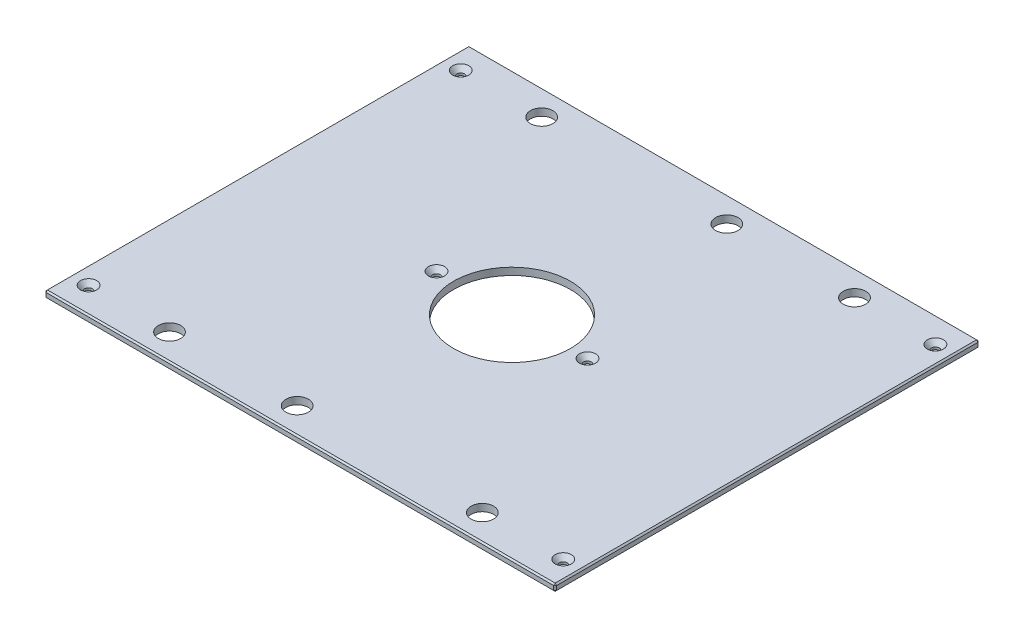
ISO-10303-21;
HEADER;
FILE_DESCRIPTION(('STEP AP214'),'2;1');
FILE_NAME('part.step','',(''),(''),'','','');
FILE_SCHEMA(('AUTOMOTIVE_DESIGN { 1 0 10303 214 1 1 1 1 }'));
ENDSEC;
DATA;
#1=APPLICATION_CONTEXT('core data for automotive mechanical design processes');
#2=APPLICATION_PROTOCOL_DEFINITION('international standard','automotive_design',2000,#1);
#3=PRODUCT_CONTEXT('',#1,'mechanical');
#4=PRODUCT('Part','Part','',(#3));
#5=PRODUCT_RELATED_PRODUCT_CATEGORY('part','',(#4));
#6=PRODUCT_DEFINITION_FORMATION('','',#4);
#7=PRODUCT_DEFINITION_CONTEXT('part definition',#1,'design');
#8=PRODUCT_DEFINITION('design','',#6,#7);
#9=PRODUCT_DEFINITION_SHAPE('','',#8);
#10=(LENGTH_UNIT() NAMED_UNIT(*) SI_UNIT(.MILLI.,.METRE.));
#11=(NAMED_UNIT(*) PLANE_ANGLE_UNIT() SI_UNIT($,.RADIAN.));
#12=(NAMED_UNIT(*) SI_UNIT($,.STERADIAN.) SOLID_ANGLE_UNIT());
#13=UNCERTAINTY_MEASURE_WITH_UNIT(LENGTH_MEASURE(1.E-05),#10,'distance_accuracy_value','');
#14=(GEOMETRIC_REPRESENTATION_CONTEXT(3) GLOBAL_UNCERTAINTY_ASSIGNED_CONTEXT((#13)) GLOBAL_UNIT_ASSIGNED_CONTEXT((#10,
#11,#12)) REPRESENTATION_CONTEXT('',''));
#15=CARTESIAN_POINT('',(0.,0.,0.));
#16=DIRECTION('',(0.,0.,1.));
#17=DIRECTION('',(1.,0.,0.));
#18=AXIS2_PLACEMENT_3D('',#15,#16,#17);
#19=CARTESIAN_POINT('',(-225.425,6.35,-187.325));
#20=DIRECTION('',(1.,0.,0.));
#21=DIRECTION('',(0.,0.,-1.));
#22=AXIS2_PLACEMENT_3D('',#19,#20,#21);
#23=PLANE('',#22);
#24=DIRECTION('',(0.,0.,-1.));
#25=VECTOR('',#24,1.);
#26=CARTESIAN_POINT('',(-225.425,5.08000000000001,-187.325));
#27=LINE('',#26,#25);
#28=CARTESIAN_POINT('',(-225.425,5.08000000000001,186.055));
#29=VERTEX_POINT('',#28);
#30=CARTESIAN_POINT('',(-225.425,5.08000000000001,-186.055));
#31=VERTEX_POINT('',#30);
#32=EDGE_CURVE('E135',#29,#31,#27,.T.);
#33=ORIENTED_EDGE('',*,*,#32,.T.);
#34=DIRECTION('',(0.,-1.,0.));
#35=VECTOR('',#34,1.);
#36=CARTESIAN_POINT('',(-225.425,6.35,-186.055));
#37=LINE('',#36,#35);
#38=CARTESIAN_POINT('',(-225.425,1.26999999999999,-186.055));
#39=VERTEX_POINT('',#38);
#40=EDGE_CURVE('E131',#31,#39,#37,.T.);
#41=ORIENTED_EDGE('',*,*,#40,.T.);
#42=DIRECTION('',(0.,0.,1.));
#43=VECTOR('',#42,1.);
#44=CARTESIAN_POINT('',(-225.425,1.26999999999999,-187.325));
#45=LINE('',#44,#43);
#46=CARTESIAN_POINT('',(-225.425,1.26999999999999,186.055));
#47=VERTEX_POINT('',#46);
#48=EDGE_CURVE('E126',#39,#47,#45,.T.);
#49=ORIENTED_EDGE('',*,*,#48,.T.);
#50=DIRECTION('',(0.,1.,0.));
#51=VECTOR('',#50,1.);
#52=CARTESIAN_POINT('',(-225.425,6.35,186.055));
#53=LINE('',#52,#51);
#54=EDGE_CURVE('E128',#47,#29,#53,.T.);
#55=ORIENTED_EDGE('',*,*,#54,.T.);
#56=EDGE_LOOP('',(#33,#41,#49,#55));
#57=FACE_BOUND('',#56,.T.);
#58=ADVANCED_FACE('F35',(#57),#23,.F.);
#59=CARTESIAN_POINT('',(-225.425,6.35,187.325));
#60=DIRECTION('',(0.,0.,-1.));
#61=DIRECTION('',(-1.,0.,0.));
#62=AXIS2_PLACEMENT_3D('',#59,#60,#61);
#63=PLANE('',#62);
#64=DIRECTION('',(1.,0.,0.));
#65=VECTOR('',#64,1.);
#66=CARTESIAN_POINT('',(-225.425,1.26999999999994,187.325));
#67=LINE('',#66,#65);
#68=CARTESIAN_POINT('',(-224.155,1.26999999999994,187.325));
#69=VERTEX_POINT('',#68);
#70=CARTESIAN_POINT('',(224.155,1.26999999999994,187.325));
#71=VERTEX_POINT('',#70);
#72=EDGE_CURVE('E58',#69,#71,#67,.T.);
#73=ORIENTED_EDGE('',*,*,#72,.T.);
#74=DIRECTION('',(0.,1.,0.));
#75=VECTOR('',#74,1.);
#76=CARTESIAN_POINT('',(224.155,6.35,187.325));
#77=LINE('',#76,#75);
#78=CARTESIAN_POINT('',(224.155,5.08000000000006,187.325));
#79=VERTEX_POINT('',#78);
#80=EDGE_CURVE('E11',#71,#79,#77,.T.);
#81=ORIENTED_EDGE('',*,*,#80,.T.);
#82=DIRECTION('',(-1.,0.,0.));
#83=VECTOR('',#82,1.);
#84=CARTESIAN_POINT('',(-225.425,5.08000000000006,187.325));
#85=LINE('',#84,#83);
#86=CARTESIAN_POINT('',(-224.155,5.08000000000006,187.325));
#87=VERTEX_POINT('',#86);
#88=EDGE_CURVE('E44',#79,#87,#85,.T.);
#89=ORIENTED_EDGE('',*,*,#88,.T.);
#90=DIRECTION('',(0.,-1.,0.));
#91=VECTOR('',#90,1.);
#92=CARTESIAN_POINT('',(-224.155,6.35,187.325));
#93=LINE('',#92,#91);
#94=EDGE_CURVE('E291',#87,#69,#93,.T.);
#95=ORIENTED_EDGE('',*,*,#94,.T.);
#96=EDGE_LOOP('',(#73,#81,#89,#95));
#97=FACE_BOUND('',#96,.T.);
#98=ADVANCED_FACE('F360',(#97),#63,.F.);
#99=CARTESIAN_POINT('',(225.425,6.35,-187.325));
#100=DIRECTION('',(-1.,0.,0.));
#101=DIRECTION('',(0.,0.,1.));
#102=AXIS2_PLACEMENT_3D('',#99,#100,#101);
#103=PLANE('',#102);
#104=DIRECTION('',(0.,0.,-1.));
#105=VECTOR('',#104,1.);
#106=CARTESIAN_POINT('',(225.425,1.26999999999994,-187.325));
#107=LINE('',#106,#105);
#108=CARTESIAN_POINT('',(225.425,1.26999999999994,186.055));
#109=VERTEX_POINT('',#108);
#110=CARTESIAN_POINT('',(225.425,1.26999999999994,-186.055));
#111=VERTEX_POINT('',#110);
#112=EDGE_CURVE('E286',#109,#111,#107,.T.);
#113=ORIENTED_EDGE('',*,*,#112,.T.);
#114=DIRECTION('',(0.,1.,0.));
#115=VECTOR('',#114,1.);
#116=CARTESIAN_POINT('',(225.425,6.35,-186.055));
#117=LINE('',#116,#115);
#118=CARTESIAN_POINT('',(225.425,5.08000000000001,-186.055));
#119=VERTEX_POINT('',#118);
#120=EDGE_CURVE('E288',#111,#119,#117,.T.);
#121=ORIENTED_EDGE('',*,*,#120,.T.);
#122=DIRECTION('',(0.,0.,1.));
#123=VECTOR('',#122,1.);
#124=CARTESIAN_POINT('',(225.425,5.08000000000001,187.325));
#125=LINE('',#124,#123);
#126=CARTESIAN_POINT('',(225.425,5.08000000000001,186.055));
#127=VERTEX_POINT('',#126);
#128=EDGE_CURVE('E284',#119,#127,#125,.T.);
#129=ORIENTED_EDGE('',*,*,#128,.T.);
#130=DIRECTION('',(0.,-1.,0.));
#131=VECTOR('',#130,1.);
#132=CARTESIAN_POINT('',(225.425,6.35,186.055));
#133=LINE('',#132,#131);
#134=EDGE_CURVE('E282',#127,#109,#133,.T.);
#135=ORIENTED_EDGE('',*,*,#134,.T.);
#136=EDGE_LOOP('',(#113,#121,#129,#135));
#137=FACE_BOUND('',#136,.T.);
#138=ADVANCED_FACE('F347',(#137),#103,.F.);
#139=CARTESIAN_POINT('',(-225.425,6.35,-187.325));
#140=DIRECTION('',(0.,0.,1.));
#141=DIRECTION('',(1.,0.,0.));
#142=AXIS2_PLACEMENT_3D('',#139,#140,#141);
#143=PLANE('',#142);
#144=DIRECTION('',(-1.,0.,0.));
#145=VECTOR('',#144,1.);
#146=CARTESIAN_POINT('',(-225.425,1.26999999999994,-187.325));
#147=LINE('',#146,#145);
#148=CARTESIAN_POINT('',(224.155,1.26999999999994,-187.325));
#149=VERTEX_POINT('',#148);
#150=CARTESIAN_POINT('',(-224.155,1.26999999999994,-187.325));
#151=VERTEX_POINT('',#150);
#152=EDGE_CURVE('E258',#149,#151,#147,.T.);
#153=ORIENTED_EDGE('',*,*,#152,.T.);
#154=DIRECTION('',(0.,1.,0.));
#155=VECTOR('',#154,1.);
#156=CARTESIAN_POINT('',(-224.155,6.35,-187.325));
#157=LINE('',#156,#155);
#158=CARTESIAN_POINT('',(-224.155,5.08000000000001,-187.325));
#159=VERTEX_POINT('',#158);
#160=EDGE_CURVE('E262',#151,#159,#157,.T.);
#161=ORIENTED_EDGE('',*,*,#160,.T.);
#162=DIRECTION('',(1.,0.,0.));
#163=VECTOR('',#162,1.);
#164=CARTESIAN_POINT('',(225.425,5.08000000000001,-187.325));
#165=LINE('',#164,#163);
#166=CARTESIAN_POINT('',(224.155,5.08000000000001,-187.325));
#167=VERTEX_POINT('',#166);
#168=EDGE_CURVE('E260',#159,#167,#165,.T.);
#169=ORIENTED_EDGE('',*,*,#168,.T.);
#170=DIRECTION('',(0.,-1.,0.));
#171=VECTOR('',#170,1.);
#172=CARTESIAN_POINT('',(224.155,6.35,-187.325));
#173=LINE('',#172,#171);
#174=EDGE_CURVE('E256',#167,#149,#173,.T.);
#175=ORIENTED_EDGE('',*,*,#174,.T.);
#176=EDGE_LOOP('',(#153,#161,#169,#175));
#177=FACE_BOUND('',#176,.T.);
#178=ADVANCED_FACE('F321',(#177),#143,.F.);
#179=CARTESIAN_POINT('',(0.,6.35,0.));
#180=DIRECTION('',(0.,1.,0.));
#181=DIRECTION('',(0.,0.,1.));
#182=AXIS2_PLACEMENT_3D('',#179,#180,#181);
#183=PLANE('',#182);
#184=CARTESIAN_POINT('',(209.55,6.35,-164.30498));
#185=DIRECTION('',(0.,1.,0.));
#186=DIRECTION('',(0.,0.,1.));
#187=AXIS2_PLACEMENT_3D('',#184,#185,#186);
#188=CIRCLE('',#187,7.13739999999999);
#189=CARTESIAN_POINT('',(209.55,6.35,-157.16758));
#190=VERTEX_POINT('',#189);
#191=EDGE_CURVE('E784',#190,#190,#188,.T.);
#192=ORIENTED_EDGE('',*,*,#191,.F.);
#193=EDGE_LOOP('',(#192));
#194=FACE_BOUND('',#193,.T.);
#195=CARTESIAN_POINT('',(209.55,6.35,164.30498));
#196=DIRECTION('',(0.,1.,0.));
#197=DIRECTION('',(0.,0.,1.));
#198=AXIS2_PLACEMENT_3D('',#195,#196,#197);
#199=CIRCLE('',#198,7.13739999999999);
#200=CARTESIAN_POINT('',(209.55,6.35,171.44238));
#201=VERTEX_POINT('',#200);
#202=EDGE_CURVE('E788',#201,#201,#199,.T.);
#203=ORIENTED_EDGE('',*,*,#202,.F.);
#204=EDGE_LOOP('',(#203));
#205=FACE_BOUND('',#204,.T.);
#206=CARTESIAN_POINT('',(-209.55,6.35,164.30498));
#207=DIRECTION('',(0.,1.,0.));
#208=DIRECTION('',(0.,0.,1.));
#209=AXIS2_PLACEMENT_3D('',#206,#207,#208);
#210=CIRCLE('',#209,7.13739999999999);
#211=CARTESIAN_POINT('',(-209.55,6.35,171.44238));
#212=VERTEX_POINT('',#211);
#213=EDGE_CURVE('E792',#212,#212,#210,.T.);
#214=ORIENTED_EDGE('',*,*,#213,.F.);
#215=EDGE_LOOP('',(#214));
#216=FACE_BOUND('',#215,.T.);
#217=CARTESIAN_POINT('',(-66.675,6.35,0.));
#218=DIRECTION('',(0.,1.,0.));
#219=DIRECTION('',(0.,0.,1.));
#220=AXIS2_PLACEMENT_3D('',#217,#218,#219);
#221=CIRCLE('',#220,7.1374);
#222=CARTESIAN_POINT('',(-66.675,6.35,7.1374));
#223=VERTEX_POINT('',#222);
#224=EDGE_CURVE('E796',#223,#223,#221,.T.);
#225=ORIENTED_EDGE('',*,*,#224,.F.);
#226=EDGE_LOOP('',(#225));
#227=FACE_BOUND('',#226,.T.);
#228=CARTESIAN_POINT('',(66.675,6.35,0.));
#229=DIRECTION('',(0.,1.,0.));
#230=DIRECTION('',(0.,0.,1.));
#231=AXIS2_PLACEMENT_3D('',#228,#229,#230);
#232=CIRCLE('',#231,7.1374);
#233=CARTESIAN_POINT('',(66.675,6.35,7.1374));
#234=VERTEX_POINT('',#233);
#235=EDGE_CURVE('E800',#234,#234,#232,.T.);
#236=ORIENTED_EDGE('',*,*,#235,.F.);
#237=EDGE_LOOP('',(#236));
#238=FACE_BOUND('',#237,.T.);
#239=CARTESIAN_POINT('',(-209.55,6.35,-164.30498));
#240=DIRECTION('',(0.,1.,0.));
#241=DIRECTION('',(0.,0.,1.));
#242=AXIS2_PLACEMENT_3D('',#239,#240,#241);
#243=CIRCLE('',#242,7.13739999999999);
#244=CARTESIAN_POINT('',(-209.55,6.35,-157.16758));
#245=VERTEX_POINT('',#244);
#246=EDGE_CURVE('E803',#245,#245,#243,.T.);
#247=ORIENTED_EDGE('',*,*,#246,.F.);
#248=EDGE_LOOP('',(#247));
#249=FACE_BOUND('',#248,.T.);
#250=DIRECTION('',(0.,0.,-1.));
#251=VECTOR('',#250,1.);
#252=CARTESIAN_POINT('',(224.155,6.35,-187.325));
#253=LINE('',#252,#251);
#254=CARTESIAN_POINT('',(224.155,6.35,186.055));
#255=VERTEX_POINT('',#254);
#256=CARTESIAN_POINT('',(224.155,6.35,-186.055));
#257=VERTEX_POINT('',#256);
#258=EDGE_CURVE('E269',#255,#257,#253,.T.);
#259=ORIENTED_EDGE('',*,*,#258,.T.);
#260=DIRECTION('',(-1.,0.,0.));
#261=VECTOR('',#260,1.);
#262=CARTESIAN_POINT('',(-225.425,6.35,-186.055));
#263=LINE('',#262,#261);
#264=CARTESIAN_POINT('',(-224.155,6.35,-186.055));
#265=VERTEX_POINT('',#264);
#266=EDGE_CURVE('E271',#257,#265,#263,.T.);
#267=ORIENTED_EDGE('',*,*,#266,.T.);
#268=DIRECTION('',(0.,0.,1.));
#269=VECTOR('',#268,1.);
#270=CARTESIAN_POINT('',(-224.155,6.35,187.325));
#271=LINE('',#270,#269);
#272=CARTESIAN_POINT('',(-224.155,6.35,186.055));
#273=VERTEX_POINT('',#272);
#274=EDGE_CURVE('E267',#265,#273,#271,.T.);
#275=ORIENTED_EDGE('',*,*,#274,.T.);
#276=DIRECTION('',(1.,0.,0.));
#277=VECTOR('',#276,1.);
#278=CARTESIAN_POINT('',(225.425,6.35,186.055));
#279=LINE('',#278,#277);
#280=EDGE_CURVE('E265',#273,#255,#279,.T.);
#281=ORIENTED_EDGE('',*,*,#280,.T.);
#282=EDGE_LOOP('',(#259,#267,#275,#281));
#283=FACE_BOUND('',#282,.T.);
#284=CARTESIAN_POINT('',(138.1125,6.35,-164.30498));
#285=DIRECTION('',(0.,1.,0.));
#286=DIRECTION('',(0.,0.,1.));
#287=AXIS2_PLACEMENT_3D('',#284,#285,#286);
#288=CIRCLE('',#287,9.921875);
#289=CARTESIAN_POINT('',(138.1125,6.35,-154.383105));
#290=VERTEX_POINT('',#289);
#291=EDGE_CURVE('E204',#290,#290,#288,.T.);
#292=ORIENTED_EDGE('',*,*,#291,.F.);
#293=EDGE_LOOP('',(#292));
#294=FACE_BOUND('',#293,.T.);
#295=CARTESIAN_POINT('',(-138.1125,6.35,-164.30498));
#296=DIRECTION('',(0.,1.,0.));
#297=DIRECTION('',(0.,0.,1.));
#298=AXIS2_PLACEMENT_3D('',#295,#296,#297);
#299=CIRCLE('',#298,9.921875);
#300=CARTESIAN_POINT('',(-138.1125,6.35,-154.383105));
#301=VERTEX_POINT('',#300);
#302=EDGE_CURVE('E214',#301,#301,#299,.T.);
#303=ORIENTED_EDGE('',*,*,#302,.F.);
#304=EDGE_LOOP('',(#303));
#305=FACE_BOUND('',#304,.T.);
#306=CARTESIAN_POINT('',(138.1125,6.35,164.30498));
#307=DIRECTION('',(0.,1.,0.));
#308=DIRECTION('',(0.,0.,1.));
#309=AXIS2_PLACEMENT_3D('',#306,#307,#308);
#310=CIRCLE('',#309,9.921875);
#311=CARTESIAN_POINT('',(138.1125,6.35,174.226855));
#312=VERTEX_POINT('',#311);
#313=EDGE_CURVE('E225',#312,#312,#310,.T.);
#314=ORIENTED_EDGE('',*,*,#313,.F.);
#315=EDGE_LOOP('',(#314));
#316=FACE_BOUND('',#315,.T.);
#317=CARTESIAN_POINT('',(-138.1125,6.35,164.30498));
#318=DIRECTION('',(0.,1.,0.));
#319=DIRECTION('',(0.,0.,1.));
#320=AXIS2_PLACEMENT_3D('',#317,#318,#319);
#321=CIRCLE('',#320,9.921875);
#322=CARTESIAN_POINT('',(-138.1125,6.35,174.226855));
#323=VERTEX_POINT('',#322);
#324=EDGE_CURVE('E231',#323,#323,#321,.T.);
#325=ORIENTED_EDGE('',*,*,#324,.F.);
#326=EDGE_LOOP('',(#325));
#327=FACE_BOUND('',#326,.T.);
#328=CARTESIAN_POINT('',(25.4,6.35,-164.30498));
#329=DIRECTION('',(0.,1.,0.));
#330=DIRECTION('',(0.,0.,1.));
#331=AXIS2_PLACEMENT_3D('',#328,#329,#330);
#332=CIRCLE('',#331,9.921875);
#333=CARTESIAN_POINT('',(25.4,6.35,-154.383105));
#334=VERTEX_POINT('',#333);
#335=EDGE_CURVE('E237',#334,#334,#332,.T.);
#336=ORIENTED_EDGE('',*,*,#335,.F.);
#337=EDGE_LOOP('',(#336));
#338=FACE_BOUND('',#337,.T.);
#339=CARTESIAN_POINT('',(-25.4,6.35,164.30498));
#340=DIRECTION('',(0.,1.,0.));
#341=DIRECTION('',(0.,0.,1.));
#342=AXIS2_PLACEMENT_3D('',#339,#340,#341);
#343=CIRCLE('',#342,9.921875);
#344=CARTESIAN_POINT('',(-25.4,6.35,174.226855));
#345=VERTEX_POINT('',#344);
#346=EDGE_CURVE('E243',#345,#345,#343,.T.);
#347=ORIENTED_EDGE('',*,*,#346,.F.);
#348=EDGE_LOOP('',(#347));
#349=FACE_BOUND('',#348,.T.);
#350=CARTESIAN_POINT('',(0.,6.35,0.));
#351=DIRECTION('',(0.,1.,0.));
#352=DIRECTION('',(0.,0.,1.));
#353=AXIS2_PLACEMENT_3D('',#350,#351,#352);
#354=CIRCLE('',#353,51.562);
#355=CARTESIAN_POINT('',(0.,6.35,51.562));
#356=VERTEX_POINT('',#355);
#357=EDGE_CURVE('E249',#356,#356,#354,.T.);
#358=ORIENTED_EDGE('',*,*,#357,.F.);
#359=EDGE_LOOP('',(#358));
#360=FACE_BOUND('',#359,.T.);
#361=ADVANCED_FACE('F369',(#194,#205,#216,#227,#238,#249,#283,#294,#305,#316,#327,#338,#349,
#360),#183,.T.);
#362=CARTESIAN_POINT('',(0.,0.,0.));
#363=DIRECTION('',(0.,1.,0.));
#364=DIRECTION('',(0.,0.,1.));
#365=AXIS2_PLACEMENT_3D('',#362,#363,#364);
#366=PLANE('',#365);
#367=CARTESIAN_POINT('',(209.55,0.,-164.30498));
#368=DIRECTION('',(0.,1.,0.));
#369=DIRECTION('',(0.,0.,1.));
#370=AXIS2_PLACEMENT_3D('',#367,#368,#369);
#371=CIRCLE('',#370,3.3782);
#372=CARTESIAN_POINT('',(209.55,0.,-160.92678));
#373=VERTEX_POINT('',#372);
#374=EDGE_CURVE('E837',#373,#373,#371,.T.);
#375=ORIENTED_EDGE('',*,*,#374,.T.);
#376=EDGE_LOOP('',(#375));
#377=FACE_BOUND('',#376,.T.);
#378=CARTESIAN_POINT('',(209.55,0.,164.30498));
#379=DIRECTION('',(0.,1.,0.));
#380=DIRECTION('',(0.,0.,1.));
#381=AXIS2_PLACEMENT_3D('',#378,#379,#380);
#382=CIRCLE('',#381,3.3782);
#383=CARTESIAN_POINT('',(209.55,0.,167.68318));
#384=VERTEX_POINT('',#383);
#385=EDGE_CURVE('E830',#384,#384,#382,.T.);
#386=ORIENTED_EDGE('',*,*,#385,.T.);
#387=EDGE_LOOP('',(#386));
#388=FACE_BOUND('',#387,.T.);
#389=CARTESIAN_POINT('',(-209.55,0.,164.30498));
#390=DIRECTION('',(0.,1.,0.));
#391=DIRECTION('',(0.,0.,1.));
#392=AXIS2_PLACEMENT_3D('',#389,#390,#391);
#393=CIRCLE('',#392,3.3782);
#394=CARTESIAN_POINT('',(-209.55,0.,167.68318));
#395=VERTEX_POINT('',#394);
#396=EDGE_CURVE('E823',#395,#395,#393,.T.);
#397=ORIENTED_EDGE('',*,*,#396,.T.);
#398=EDGE_LOOP('',(#397));
#399=FACE_BOUND('',#398,.T.);
#400=CARTESIAN_POINT('',(-66.675,0.,0.));
#401=DIRECTION('',(0.,1.,0.));
#402=DIRECTION('',(0.,0.,1.));
#403=AXIS2_PLACEMENT_3D('',#400,#401,#402);
#404=CIRCLE('',#403,3.3782);
#405=CARTESIAN_POINT('',(-66.675,0.,3.3782));
#406=VERTEX_POINT('',#405);
#407=EDGE_CURVE('E816',#406,#406,#404,.T.);
#408=ORIENTED_EDGE('',*,*,#407,.T.);
#409=EDGE_LOOP('',(#408));
#410=FACE_BOUND('',#409,.T.);
#411=CARTESIAN_POINT('',(66.675,0.,0.));
#412=DIRECTION('',(0.,1.,0.));
#413=DIRECTION('',(0.,0.,1.));
#414=AXIS2_PLACEMENT_3D('',#411,#412,#413);
#415=CIRCLE('',#414,3.3782);
#416=CARTESIAN_POINT('',(66.675,0.,3.3782));
#417=VERTEX_POINT('',#416);
#418=EDGE_CURVE('E806',#417,#417,#415,.T.);
#419=ORIENTED_EDGE('',*,*,#418,.T.);
#420=EDGE_LOOP('',(#419));
#421=FACE_BOUND('',#420,.T.);
#422=CARTESIAN_POINT('',(-209.55,0.,-164.30498));
#423=DIRECTION('',(0.,1.,0.));
#424=DIRECTION('',(0.,0.,1.));
#425=AXIS2_PLACEMENT_3D('',#422,#423,#424);
#426=CIRCLE('',#425,3.3782);
#427=CARTESIAN_POINT('',(-209.55,0.,-160.92678));
#428=VERTEX_POINT('',#427);
#429=EDGE_CURVE('E217',#428,#428,#426,.T.);
#430=ORIENTED_EDGE('',*,*,#429,.T.);
#431=EDGE_LOOP('',(#430));
#432=FACE_BOUND('',#431,.T.);
#433=DIRECTION('',(0.,0.,-1.));
#434=VECTOR('',#433,1.);
#435=CARTESIAN_POINT('',(-224.155,0.,0.));
#436=LINE('',#435,#434);
#437=CARTESIAN_POINT('',(-224.155,0.,186.055));
#438=VERTEX_POINT('',#437);
#439=CARTESIAN_POINT('',(-224.155,0.,-186.055));
#440=VERTEX_POINT('',#439);
#441=EDGE_CURVE('E158',#438,#440,#436,.T.);
#442=ORIENTED_EDGE('',*,*,#441,.T.);
#443=DIRECTION('',(1.,0.,0.));
#444=VECTOR('',#443,1.);
#445=CARTESIAN_POINT('',(0.,0.,-186.055));
#446=LINE('',#445,#444);
#447=CARTESIAN_POINT('',(224.155,0.,-186.055));
#448=VERTEX_POINT('',#447);
#449=EDGE_CURVE('E279',#440,#448,#446,.T.);
#450=ORIENTED_EDGE('',*,*,#449,.T.);
#451=DIRECTION('',(0.,0.,1.));
#452=VECTOR('',#451,1.);
#453=CARTESIAN_POINT('',(224.155,0.,0.));
#454=LINE('',#453,#452);
#455=CARTESIAN_POINT('',(224.155,0.,186.055));
#456=VERTEX_POINT('',#455);
#457=EDGE_CURVE('E277',#448,#456,#454,.T.);
#458=ORIENTED_EDGE('',*,*,#457,.T.);
#459=DIRECTION('',(-1.,0.,0.));
#460=VECTOR('',#459,1.);
#461=CARTESIAN_POINT('',(0.,0.,186.055));
#462=LINE('',#461,#460);
#463=EDGE_CURVE('E274',#456,#438,#462,.T.);
#464=ORIENTED_EDGE('',*,*,#463,.T.);
#465=EDGE_LOOP('',(#442,#450,#458,#464));
#466=FACE_BOUND('',#465,.T.);
#467=CARTESIAN_POINT('',(138.1125,0.,-164.30498));
#468=DIRECTION('',(0.,1.,0.));
#469=DIRECTION('',(0.,0.,1.));
#470=AXIS2_PLACEMENT_3D('',#467,#468,#469);
#471=CIRCLE('',#470,9.921875);
#472=CARTESIAN_POINT('',(138.1125,0.,-154.383105));
#473=VERTEX_POINT('',#472);
#474=EDGE_CURVE('E209',#473,#473,#471,.T.);
#475=ORIENTED_EDGE('',*,*,#474,.T.);
#476=EDGE_LOOP('',(#475));
#477=FACE_BOUND('',#476,.T.);
#478=CARTESIAN_POINT('',(-138.1125,0.,-164.30498));
#479=DIRECTION('',(0.,1.,0.));
#480=DIRECTION('',(0.,0.,1.));
#481=AXIS2_PLACEMENT_3D('',#478,#479,#480);
#482=CIRCLE('',#481,9.921875);
#483=CARTESIAN_POINT('',(-138.1125,0.,-154.383105));
#484=VERTEX_POINT('',#483);
#485=EDGE_CURVE('E222',#484,#484,#482,.T.);
#486=ORIENTED_EDGE('',*,*,#485,.T.);
#487=EDGE_LOOP('',(#486));
#488=FACE_BOUND('',#487,.T.);
#489=CARTESIAN_POINT('',(138.1125,0.,164.30498));
#490=DIRECTION('',(0.,1.,0.));
#491=DIRECTION('',(0.,0.,1.));
#492=AXIS2_PLACEMENT_3D('',#489,#490,#491);
#493=CIRCLE('',#492,9.921875);
#494=CARTESIAN_POINT('',(138.1125,0.,174.226855));
#495=VERTEX_POINT('',#494);
#496=EDGE_CURVE('E228',#495,#495,#493,.T.);
#497=ORIENTED_EDGE('',*,*,#496,.T.);
#498=EDGE_LOOP('',(#497));
#499=FACE_BOUND('',#498,.T.);
#500=CARTESIAN_POINT('',(-138.1125,0.,164.30498));
#501=DIRECTION('',(0.,1.,0.));
#502=DIRECTION('',(0.,0.,1.));
#503=AXIS2_PLACEMENT_3D('',#500,#501,#502);
#504=CIRCLE('',#503,9.921875);
#505=CARTESIAN_POINT('',(-138.1125,0.,174.226855));
#506=VERTEX_POINT('',#505);
#507=EDGE_CURVE('E234',#506,#506,#504,.T.);
#508=ORIENTED_EDGE('',*,*,#507,.T.);
#509=EDGE_LOOP('',(#508));
#510=FACE_BOUND('',#509,.T.);
#511=CARTESIAN_POINT('',(25.4,0.,-164.30498));
#512=DIRECTION('',(0.,1.,0.));
#513=DIRECTION('',(0.,0.,1.));
#514=AXIS2_PLACEMENT_3D('',#511,#512,#513);
#515=CIRCLE('',#514,9.921875);
#516=CARTESIAN_POINT('',(25.4,0.,-154.383105));
#517=VERTEX_POINT('',#516);
#518=EDGE_CURVE('E240',#517,#517,#515,.T.);
#519=ORIENTED_EDGE('',*,*,#518,.T.);
#520=EDGE_LOOP('',(#519));
#521=FACE_BOUND('',#520,.T.);
#522=CARTESIAN_POINT('',(-25.4,0.,164.30498));
#523=DIRECTION('',(0.,1.,0.));
#524=DIRECTION('',(0.,0.,1.));
#525=AXIS2_PLACEMENT_3D('',#522,#523,#524);
#526=CIRCLE('',#525,9.921875);
#527=CARTESIAN_POINT('',(-25.4,0.,174.226855));
#528=VERTEX_POINT('',#527);
#529=EDGE_CURVE('E246',#528,#528,#526,.T.);
#530=ORIENTED_EDGE('',*,*,#529,.T.);
#531=EDGE_LOOP('',(#530));
#532=FACE_BOUND('',#531,.T.);
#533=CARTESIAN_POINT('',(0.,0.,0.));
#534=DIRECTION('',(0.,1.,0.));
#535=DIRECTION('',(0.,0.,1.));
#536=AXIS2_PLACEMENT_3D('',#533,#534,#535);
#537=CIRCLE('',#536,51.562);
#538=CARTESIAN_POINT('',(0.,0.,51.562));
#539=VERTEX_POINT('',#538);
#540=EDGE_CURVE('E147',#539,#539,#537,.T.);
#541=ORIENTED_EDGE('',*,*,#540,.T.);
#542=EDGE_LOOP('',(#541));
#543=FACE_BOUND('',#542,.T.);
#544=ADVANCED_FACE('F334',(#377,#388,#399,#410,#421,#432,#466,#477,#488,#499,#510,#521,#532,
#543),#366,.F.);
#545=CARTESIAN_POINT('',(0.,0.,0.));
#546=DIRECTION('',(0.,1.,0.));
#547=DIRECTION('',(0.,0.,1.));
#548=AXIS2_PLACEMENT_3D('',#545,#546,#547);
#549=CYLINDRICAL_SURFACE('',#548,51.562);
#550=ORIENTED_EDGE('',*,*,#540,.F.);
#551=EDGE_LOOP('',(#550));
#552=FACE_BOUND('',#551,.T.);
#553=ORIENTED_EDGE('',*,*,#357,.T.);
#554=EDGE_LOOP('',(#553));
#555=FACE_BOUND('',#554,.T.);
#556=ADVANCED_FACE('F721',(#552,#555),#549,.F.);
#557=CARTESIAN_POINT('',(-25.4,6.35,164.30498));
#558=DIRECTION('',(0.,1.,0.));
#559=DIRECTION('',(0.,0.,1.));
#560=AXIS2_PLACEMENT_3D('',#557,#558,#559);
#561=CYLINDRICAL_SURFACE('',#560,9.921875);
#562=ORIENTED_EDGE('',*,*,#529,.F.);
#563=EDGE_LOOP('',(#562));
#564=FACE_BOUND('',#563,.T.);
#565=ORIENTED_EDGE('',*,*,#346,.T.);
#566=EDGE_LOOP('',(#565));
#567=FACE_BOUND('',#566,.T.);
#568=ADVANCED_FACE('F712',(#564,#567),#561,.F.);
#569=CARTESIAN_POINT('',(25.4,6.35,-164.30498));
#570=DIRECTION('',(0.,1.,0.));
#571=DIRECTION('',(0.,0.,1.));
#572=AXIS2_PLACEMENT_3D('',#569,#570,#571);
#573=CYLINDRICAL_SURFACE('',#572,9.921875);
#574=ORIENTED_EDGE('',*,*,#518,.F.);
#575=EDGE_LOOP('',(#574));
#576=FACE_BOUND('',#575,.T.);
#577=ORIENTED_EDGE('',*,*,#335,.T.);
#578=EDGE_LOOP('',(#577));
#579=FACE_BOUND('',#578,.T.);
#580=ADVANCED_FACE('F703',(#576,#579),#573,.F.);
#581=CARTESIAN_POINT('',(-138.1125,6.35,164.30498));
#582=DIRECTION('',(0.,1.,0.));
#583=DIRECTION('',(0.,0.,1.));
#584=AXIS2_PLACEMENT_3D('',#581,#582,#583);
#585=CYLINDRICAL_SURFACE('',#584,9.921875);
#586=ORIENTED_EDGE('',*,*,#507,.F.);
#587=EDGE_LOOP('',(#586));
#588=FACE_BOUND('',#587,.T.);
#589=ORIENTED_EDGE('',*,*,#324,.T.);
#590=EDGE_LOOP('',(#589));
#591=FACE_BOUND('',#590,.T.);
#592=ADVANCED_FACE('F694',(#588,#591),#585,.F.);
#593=CARTESIAN_POINT('',(138.1125,6.35,164.30498));
#594=DIRECTION('',(0.,1.,0.));
#595=DIRECTION('',(0.,0.,1.));
#596=AXIS2_PLACEMENT_3D('',#593,#594,#595);
#597=CYLINDRICAL_SURFACE('',#596,9.921875);
#598=ORIENTED_EDGE('',*,*,#496,.F.);
#599=EDGE_LOOP('',(#598));
#600=FACE_BOUND('',#599,.T.);
#601=ORIENTED_EDGE('',*,*,#313,.T.);
#602=EDGE_LOOP('',(#601));
#603=FACE_BOUND('',#602,.T.);
#604=ADVANCED_FACE('F685',(#600,#603),#597,.F.);
#605=CARTESIAN_POINT('',(-138.1125,6.35,-164.30498));
#606=DIRECTION('',(0.,1.,0.));
#607=DIRECTION('',(0.,0.,1.));
#608=AXIS2_PLACEMENT_3D('',#605,#606,#607);
#609=CYLINDRICAL_SURFACE('',#608,9.921875);
#610=ORIENTED_EDGE('',*,*,#485,.F.);
#611=EDGE_LOOP('',(#610));
#612=FACE_BOUND('',#611,.T.);
#613=ORIENTED_EDGE('',*,*,#302,.T.);
#614=EDGE_LOOP('',(#613));
#615=FACE_BOUND('',#614,.T.);
#616=ADVANCED_FACE('F675',(#612,#615),#609,.F.);
#617=CARTESIAN_POINT('',(138.1125,6.35,-164.30498));
#618=DIRECTION('',(0.,1.,0.));
#619=DIRECTION('',(0.,0.,1.));
#620=AXIS2_PLACEMENT_3D('',#617,#618,#619);
#621=CYLINDRICAL_SURFACE('',#620,9.921875);
#622=ORIENTED_EDGE('',*,*,#474,.F.);
#623=EDGE_LOOP('',(#622));
#624=FACE_BOUND('',#623,.T.);
#625=ORIENTED_EDGE('',*,*,#291,.T.);
#626=EDGE_LOOP('',(#625));
#627=FACE_BOUND('',#626,.T.);
#628=ADVANCED_FACE('F378',(#624,#627),#621,.F.);
#629=CARTESIAN_POINT('',(225.425,6.35,186.055));
#630=DIRECTION('',(-0.707106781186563,0.,-0.707106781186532));
#631=DIRECTION('',(0.,-1.,0.));
#632=AXIS2_PLACEMENT_3D('',#629,#630,#631);
#633=PLANE('',#632);
#634=DIRECTION('',(-0.707106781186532,0.,0.707106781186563));
#635=VECTOR('',#634,1.);
#636=CARTESIAN_POINT('',(225.425,5.08000000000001,186.055));
#637=LINE('',#636,#635);
#638=EDGE_CURVE('E39',#79,#127,#637,.F.);
#639=ORIENTED_EDGE('',*,*,#638,.F.);
#640=ORIENTED_EDGE('',*,*,#80,.F.);
#641=DIRECTION('',(0.707106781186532,0.,-0.707106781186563));
#642=VECTOR('',#641,1.);
#643=CARTESIAN_POINT('',(224.79,1.26999999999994,186.69));
#644=LINE('',#643,#642);
#645=EDGE_CURVE('E197',#109,#71,#644,.F.);
#646=ORIENTED_EDGE('',*,*,#645,.F.);
#647=ORIENTED_EDGE('',*,*,#134,.F.);
#648=EDGE_LOOP('',(#639,#640,#646,#647));
#649=FACE_BOUND('',#648,.T.);
#650=ADVANCED_FACE('F37',(#649),#633,.F.);
#651=CARTESIAN_POINT('',(225.425,5.08000000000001,186.055));
#652=DIRECTION('',(0.577350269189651,0.577350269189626,0.577350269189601));
#653=DIRECTION('',(-0.707106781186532,0.707106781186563,0.));
#654=AXIS2_PLACEMENT_3D('',#651,#652,#653);
#655=PLANE('',#654);
#656=DIRECTION('',(0.,-0.707106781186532,0.707106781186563));
#657=VECTOR('',#656,1.);
#658=CARTESIAN_POINT('',(224.155,5.71500000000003,186.69));
#659=LINE('',#658,#657);
#660=EDGE_CURVE('E193',#79,#255,#659,.F.);
#661=ORIENTED_EDGE('',*,*,#660,.F.);
#662=ORIENTED_EDGE('',*,*,#638,.T.);
#663=DIRECTION('',(-0.707106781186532,0.707106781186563,0.));
#664=VECTOR('',#663,1.);
#665=CARTESIAN_POINT('',(225.425,5.08000000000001,186.055));
#666=LINE('',#665,#664);
#667=EDGE_CURVE('E195',#255,#127,#666,.F.);
#668=ORIENTED_EDGE('',*,*,#667,.F.);
#669=EDGE_LOOP('',(#661,#662,#668));
#670=FACE_BOUND('',#669,.T.);
#671=ADVANCED_FACE('F371',(#670),#655,.T.);
#672=CARTESIAN_POINT('',(224.155,0.,186.055));
#673=DIRECTION('',(0.577350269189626,-0.577350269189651,0.577350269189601));
#674=DIRECTION('',(0.707106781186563,0.707106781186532,0.));
#675=AXIS2_PLACEMENT_3D('',#672,#673,#674);
#676=PLANE('',#675);
#677=DIRECTION('',(-0.707106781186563,-0.707106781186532,0.));
#678=VECTOR('',#677,1.);
#679=CARTESIAN_POINT('',(224.155,0.,186.055));
#680=LINE('',#679,#678);
#681=EDGE_CURVE('E187',#109,#456,#680,.T.);
#682=ORIENTED_EDGE('',*,*,#681,.F.);
#683=ORIENTED_EDGE('',*,*,#645,.T.);
#684=DIRECTION('',(0.,0.707106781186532,0.707106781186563));
#685=VECTOR('',#684,1.);
#686=CARTESIAN_POINT('',(224.155,0.,186.055));
#687=LINE('',#686,#685);
#688=EDGE_CURVE('E190',#456,#71,#687,.T.);
#689=ORIENTED_EDGE('',*,*,#688,.F.);
#690=EDGE_LOOP('',(#682,#683,#689));
#691=FACE_BOUND('',#690,.T.);
#692=ADVANCED_FACE('F340',(#691),#676,.T.);
#693=CARTESIAN_POINT('',(224.155,6.35,0.));
#694=DIRECTION('',(0.707106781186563,0.707106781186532,0.));
#695=DIRECTION('',(0.,0.,1.));
#696=AXIS2_PLACEMENT_3D('',#693,#694,#695);
#697=PLANE('',#696);
#698=ORIENTED_EDGE('',*,*,#667,.T.);
#699=ORIENTED_EDGE('',*,*,#128,.F.);
#700=DIRECTION('',(0.707106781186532,-0.707106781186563,0.));
#701=VECTOR('',#700,1.);
#702=CARTESIAN_POINT('',(224.79,5.715,-186.055));
#703=LINE('',#702,#701);
#704=EDGE_CURVE('E182',#257,#119,#703,.T.);
#705=ORIENTED_EDGE('',*,*,#704,.F.);
#706=ORIENTED_EDGE('',*,*,#258,.F.);
#707=EDGE_LOOP('',(#698,#699,#705,#706));
#708=FACE_BOUND('',#707,.T.);
#709=ADVANCED_FACE('F357',(#708),#697,.T.);
#710=CARTESIAN_POINT('',(0.,6.35,186.055));
#711=DIRECTION('',(0.,0.707106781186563,0.707106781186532));
#712=DIRECTION('',(-1.,0.,0.));
#713=AXIS2_PLACEMENT_3D('',#710,#711,#712);
#714=PLANE('',#713);
#715=ORIENTED_EDGE('',*,*,#660,.T.);
#716=ORIENTED_EDGE('',*,*,#280,.F.);
#717=DIRECTION('',(0.,0.707106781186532,-0.707106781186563));
#718=VECTOR('',#717,1.);
#719=CARTESIAN_POINT('',(-224.155,6.35,186.055));
#720=LINE('',#719,#718);
#721=EDGE_CURVE('E179',#87,#273,#720,.T.);
#722=ORIENTED_EDGE('',*,*,#721,.F.);
#723=ORIENTED_EDGE('',*,*,#88,.F.);
#724=EDGE_LOOP('',(#715,#716,#722,#723));
#725=FACE_BOUND('',#724,.T.);
#726=ADVANCED_FACE('F362',(#725),#714,.T.);
#727=CARTESIAN_POINT('',(-224.155,6.35,187.325));
#728=DIRECTION('',(0.707106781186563,0.,-0.707106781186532));
#729=DIRECTION('',(0.,-1.,0.));
#730=AXIS2_PLACEMENT_3D('',#727,#728,#729);
#731=PLANE('',#730);
#732=DIRECTION('',(0.707106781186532,0.,0.707106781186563));
#733=VECTOR('',#732,1.);
#734=CARTESIAN_POINT('',(-225.425,1.26999999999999,186.055));
#735=LINE('',#734,#733);
#736=EDGE_CURVE('E142',#69,#47,#735,.F.);
#737=ORIENTED_EDGE('',*,*,#736,.F.);
#738=ORIENTED_EDGE('',*,*,#94,.F.);
#739=DIRECTION('',(-0.707106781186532,0.,-0.707106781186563));
#740=VECTOR('',#739,1.);
#741=CARTESIAN_POINT('',(-224.79,5.08000000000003,186.69));
#742=LINE('',#741,#740);
#743=EDGE_CURVE('E145',#29,#87,#742,.F.);
#744=ORIENTED_EDGE('',*,*,#743,.F.);
#745=ORIENTED_EDGE('',*,*,#54,.F.);
#746=EDGE_LOOP('',(#737,#738,#744,#745));
#747=FACE_BOUND('',#746,.T.);
#748=ADVANCED_FACE('F140',(#747),#731,.F.);
#749=CARTESIAN_POINT('',(-225.425,1.26999999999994,187.325));
#750=DIRECTION('',(0.,0.707106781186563,-0.707106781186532));
#751=DIRECTION('',(1.,0.,0.));
#752=AXIS2_PLACEMENT_3D('',#749,#750,#751);
#753=PLANE('',#752);
#754=ORIENTED_EDGE('',*,*,#688,.T.);
#755=ORIENTED_EDGE('',*,*,#72,.F.);
#756=DIRECTION('',(0.,-0.707106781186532,-0.707106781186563));
#757=VECTOR('',#756,1.);
#758=CARTESIAN_POINT('',(-224.155,0.634999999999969,186.69));
#759=LINE('',#758,#757);
#760=EDGE_CURVE('E155',#438,#69,#759,.F.);
#761=ORIENTED_EDGE('',*,*,#760,.F.);
#762=ORIENTED_EDGE('',*,*,#463,.F.);
#763=EDGE_LOOP('',(#754,#755,#761,#762));
#764=FACE_BOUND('',#763,.T.);
#765=ADVANCED_FACE('F339',(#764),#753,.F.);
#766=CARTESIAN_POINT('',(225.425,1.26999999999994,-187.325));
#767=DIRECTION('',(-0.707106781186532,0.707106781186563,0.));
#768=DIRECTION('',(0.,0.,-1.));
#769=AXIS2_PLACEMENT_3D('',#766,#767,#768);
#770=PLANE('',#769);
#771=ORIENTED_EDGE('',*,*,#681,.T.);
#772=ORIENTED_EDGE('',*,*,#457,.F.);
#773=DIRECTION('',(0.707106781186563,0.707106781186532,0.));
#774=VECTOR('',#773,1.);
#775=CARTESIAN_POINT('',(224.155,0.,-186.055));
#776=LINE('',#775,#774);
#777=EDGE_CURVE('E174',#111,#448,#776,.F.);
#778=ORIENTED_EDGE('',*,*,#777,.F.);
#779=ORIENTED_EDGE('',*,*,#112,.F.);
#780=EDGE_LOOP('',(#771,#772,#778,#779));
#781=FACE_BOUND('',#780,.T.);
#782=ADVANCED_FACE('F344',(#781),#770,.F.);
#783=CARTESIAN_POINT('',(224.155,6.35,-187.325));
#784=DIRECTION('',(-0.707106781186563,0.,0.707106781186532));
#785=DIRECTION('',(0.,-1.,0.));
#786=AXIS2_PLACEMENT_3D('',#783,#784,#785);
#787=PLANE('',#786);
#788=DIRECTION('',(0.707106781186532,0.,0.707106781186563));
#789=VECTOR('',#788,1.);
#790=CARTESIAN_POINT('',(224.155,5.08000000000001,-187.325));
#791=LINE('',#790,#789);
#792=EDGE_CURVE('E184',#119,#167,#791,.F.);
#793=ORIENTED_EDGE('',*,*,#792,.F.);
#794=ORIENTED_EDGE('',*,*,#120,.F.);
#795=DIRECTION('',(-0.707106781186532,0.,-0.707106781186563));
#796=VECTOR('',#795,1.);
#797=CARTESIAN_POINT('',(224.79,1.26999999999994,-186.69));
#798=LINE('',#797,#796);
#799=EDGE_CURVE('E171',#149,#111,#798,.F.);
#800=ORIENTED_EDGE('',*,*,#799,.F.);
#801=ORIENTED_EDGE('',*,*,#174,.F.);
#802=EDGE_LOOP('',(#793,#794,#800,#801));
#803=FACE_BOUND('',#802,.T.);
#804=ADVANCED_FACE('F352',(#803),#787,.F.);
#805=CARTESIAN_POINT('',(224.155,5.08000000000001,-187.325));
#806=DIRECTION('',(0.577350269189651,0.577350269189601,-0.577350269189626));
#807=DIRECTION('',(-0.707106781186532,0.,-0.707106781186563));
#808=AXIS2_PLACEMENT_3D('',#805,#806,#807);
#809=PLANE('',#808);
#810=ORIENTED_EDGE('',*,*,#704,.T.);
#811=ORIENTED_EDGE('',*,*,#792,.T.);
#812=DIRECTION('',(0.,0.707106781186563,0.707106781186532));
#813=VECTOR('',#812,1.);
#814=CARTESIAN_POINT('',(224.155,5.08000000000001,-187.325));
#815=LINE('',#814,#813);
#816=EDGE_CURVE('E163',#257,#167,#815,.F.);
#817=ORIENTED_EDGE('',*,*,#816,.F.);
#818=EDGE_LOOP('',(#810,#811,#817));
#819=FACE_BOUND('',#818,.T.);
#820=ADVANCED_FACE('F410',(#819),#809,.T.);
#821=CARTESIAN_POINT('',(-224.155,6.35,186.055));
#822=DIRECTION('',(-0.577350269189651,0.577350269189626,0.577350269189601));
#823=DIRECTION('',(-0.707106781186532,-0.707106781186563,0.));
#824=AXIS2_PLACEMENT_3D('',#821,#822,#823);
#825=PLANE('',#824);
#826=ORIENTED_EDGE('',*,*,#743,.T.);
#827=ORIENTED_EDGE('',*,*,#721,.T.);
#828=DIRECTION('',(-0.707106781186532,-0.707106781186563,0.));
#829=VECTOR('',#828,1.);
#830=CARTESIAN_POINT('',(-224.155,6.35,186.055));
#831=LINE('',#830,#829);
#832=EDGE_CURVE('E159',#29,#273,#831,.F.);
#833=ORIENTED_EDGE('',*,*,#832,.F.);
#834=EDGE_LOOP('',(#826,#827,#833));
#835=FACE_BOUND('',#834,.T.);
#836=ADVANCED_FACE('F364',(#835),#825,.T.);
#837=CARTESIAN_POINT('',(-225.425,1.26999999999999,186.055));
#838=DIRECTION('',(-0.577350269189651,-0.577350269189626,0.577350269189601));
#839=DIRECTION('',(0.707106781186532,-0.707106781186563,0.));
#840=AXIS2_PLACEMENT_3D('',#837,#838,#839);
#841=PLANE('',#840);
#842=ORIENTED_EDGE('',*,*,#760,.T.);
#843=ORIENTED_EDGE('',*,*,#736,.T.);
#844=DIRECTION('',(-0.707106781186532,0.707106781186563,0.));
#845=VECTOR('',#844,1.);
#846=CARTESIAN_POINT('',(-225.425,1.26999999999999,186.055));
#847=LINE('',#846,#845);
#848=EDGE_CURVE('E152',#438,#47,#847,.T.);
#849=ORIENTED_EDGE('',*,*,#848,.F.);
#850=EDGE_LOOP('',(#842,#843,#849));
#851=FACE_BOUND('',#850,.T.);
#852=ADVANCED_FACE('F151',(#851),#841,.T.);
#853=CARTESIAN_POINT('',(224.155,0.,-186.055));
#854=DIRECTION('',(0.577350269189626,-0.577350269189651,-0.577350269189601));
#855=DIRECTION('',(0.707106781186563,0.707106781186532,0.));
#856=AXIS2_PLACEMENT_3D('',#853,#854,#855);
#857=PLANE('',#856);
#858=ORIENTED_EDGE('',*,*,#799,.T.);
#859=ORIENTED_EDGE('',*,*,#777,.T.);
#860=DIRECTION('',(0.,-0.707106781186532,0.707106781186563));
#861=VECTOR('',#860,1.);
#862=CARTESIAN_POINT('',(224.155,0.,-186.055));
#863=LINE('',#862,#861);
#864=EDGE_CURVE('E160',#149,#448,#863,.T.);
#865=ORIENTED_EDGE('',*,*,#864,.F.);
#866=EDGE_LOOP('',(#858,#859,#865));
#867=FACE_BOUND('',#866,.T.);
#868=ADVANCED_FACE('F402',(#867),#857,.T.);
#869=CARTESIAN_POINT('',(0.,6.35,-186.055));
#870=DIRECTION('',(0.,0.707106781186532,-0.707106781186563));
#871=DIRECTION('',(1.,0.,0.));
#872=AXIS2_PLACEMENT_3D('',#869,#870,#871);
#873=PLANE('',#872);
#874=ORIENTED_EDGE('',*,*,#816,.T.);
#875=ORIENTED_EDGE('',*,*,#168,.F.);
#876=DIRECTION('',(0.,-0.707106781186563,-0.707106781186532));
#877=VECTOR('',#876,1.);
#878=CARTESIAN_POINT('',(-224.155,5.08000000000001,-187.325));
#879=LINE('',#878,#877);
#880=EDGE_CURVE('E165',#265,#159,#879,.T.);
#881=ORIENTED_EDGE('',*,*,#880,.F.);
#882=ORIENTED_EDGE('',*,*,#266,.F.);
#883=EDGE_LOOP('',(#874,#875,#881,#882));
#884=FACE_BOUND('',#883,.T.);
#885=ADVANCED_FACE('F316',(#884),#873,.T.);
#886=CARTESIAN_POINT('',(-224.155,6.35,0.));
#887=DIRECTION('',(-0.707106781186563,0.707106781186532,0.));
#888=DIRECTION('',(0.,0.,-1.));
#889=AXIS2_PLACEMENT_3D('',#886,#887,#888);
#890=PLANE('',#889);
#891=ORIENTED_EDGE('',*,*,#832,.T.);
#892=ORIENTED_EDGE('',*,*,#274,.F.);
#893=DIRECTION('',(0.707106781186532,0.707106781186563,0.));
#894=VECTOR('',#893,1.);
#895=CARTESIAN_POINT('',(-224.79,5.715,-186.055));
#896=LINE('',#895,#894);
#897=EDGE_CURVE('E305',#31,#265,#896,.T.);
#898=ORIENTED_EDGE('',*,*,#897,.F.);
#899=ORIENTED_EDGE('',*,*,#32,.F.);
#900=EDGE_LOOP('',(#891,#892,#898,#899));
#901=FACE_BOUND('',#900,.T.);
#902=ADVANCED_FACE('F367',(#901),#890,.T.);
#903=CARTESIAN_POINT('',(-225.425,1.26999999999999,-187.325));
#904=DIRECTION('',(0.707106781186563,0.707106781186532,0.));
#905=DIRECTION('',(0.,0.,1.));
#906=AXIS2_PLACEMENT_3D('',#903,#904,#905);
#907=PLANE('',#906);
#908=ORIENTED_EDGE('',*,*,#848,.T.);
#909=ORIENTED_EDGE('',*,*,#48,.F.);
#910=DIRECTION('',(0.707106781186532,-0.707106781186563,0.));
#911=VECTOR('',#910,1.);
#912=CARTESIAN_POINT('',(-225.425,1.26999999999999,-186.055));
#913=LINE('',#912,#911);
#914=EDGE_CURVE('E302',#440,#39,#913,.F.);
#915=ORIENTED_EDGE('',*,*,#914,.F.);
#916=ORIENTED_EDGE('',*,*,#441,.F.);
#917=EDGE_LOOP('',(#908,#909,#915,#916));
#918=FACE_BOUND('',#917,.T.);
#919=ADVANCED_FACE('F157',(#918),#907,.F.);
#920=CARTESIAN_POINT('',(-225.425,1.26999999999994,-187.325));
#921=DIRECTION('',(0.,0.707106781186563,0.707106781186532));
#922=DIRECTION('',(-1.,0.,0.));
#923=AXIS2_PLACEMENT_3D('',#920,#921,#922);
#924=PLANE('',#923);
#925=ORIENTED_EDGE('',*,*,#864,.T.);
#926=ORIENTED_EDGE('',*,*,#449,.F.);
#927=DIRECTION('',(0.,0.707106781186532,-0.707106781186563));
#928=VECTOR('',#927,1.);
#929=CARTESIAN_POINT('',(-224.155,0.634999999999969,-186.69));
#930=LINE('',#929,#928);
#931=EDGE_CURVE('E299',#151,#440,#930,.F.);
#932=ORIENTED_EDGE('',*,*,#931,.F.);
#933=ORIENTED_EDGE('',*,*,#152,.F.);
#934=EDGE_LOOP('',(#925,#926,#932,#933));
#935=FACE_BOUND('',#934,.T.);
#936=ADVANCED_FACE('F331',(#935),#924,.F.);
#937=CARTESIAN_POINT('',(-224.155,5.08000000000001,-187.325));
#938=DIRECTION('',(-0.577350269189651,0.577350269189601,-0.577350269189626));
#939=DIRECTION('',(-0.707106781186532,0.,0.707106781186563));
#940=AXIS2_PLACEMENT_3D('',#937,#938,#939);
#941=PLANE('',#940);
#942=ORIENTED_EDGE('',*,*,#897,.T.);
#943=ORIENTED_EDGE('',*,*,#880,.T.);
#944=DIRECTION('',(0.707106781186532,0.,-0.707106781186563));
#945=VECTOR('',#944,1.);
#946=CARTESIAN_POINT('',(-224.155,5.08000000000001,-187.325));
#947=LINE('',#946,#945);
#948=EDGE_CURVE('E297',#31,#159,#947,.T.);
#949=ORIENTED_EDGE('',*,*,#948,.F.);
#950=EDGE_LOOP('',(#942,#943,#949));
#951=FACE_BOUND('',#950,.T.);
#952=ADVANCED_FACE('F311',(#951),#941,.T.);
#953=CARTESIAN_POINT('',(-225.425,1.26999999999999,-186.055));
#954=DIRECTION('',(-0.577350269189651,-0.577350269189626,-0.577350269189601));
#955=DIRECTION('',(0.707106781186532,-0.707106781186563,0.));
#956=AXIS2_PLACEMENT_3D('',#953,#954,#955);
#957=PLANE('',#956);
#958=ORIENTED_EDGE('',*,*,#931,.T.);
#959=ORIENTED_EDGE('',*,*,#914,.T.);
#960=DIRECTION('',(-0.707106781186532,0.,0.707106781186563));
#961=VECTOR('',#960,1.);
#962=CARTESIAN_POINT('',(-225.425,1.26999999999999,-186.055));
#963=LINE('',#962,#961);
#964=EDGE_CURVE('E295',#151,#39,#963,.T.);
#965=ORIENTED_EDGE('',*,*,#964,.F.);
#966=EDGE_LOOP('',(#958,#959,#965));
#967=FACE_BOUND('',#966,.T.);
#968=ADVANCED_FACE('F328',(#967),#957,.T.);
#969=CARTESIAN_POINT('',(-225.425,6.35,-186.055));
#970=DIRECTION('',(0.707106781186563,0.,0.707106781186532));
#971=DIRECTION('',(0.,-1.,0.));
#972=AXIS2_PLACEMENT_3D('',#969,#970,#971);
#973=PLANE('',#972);
#974=ORIENTED_EDGE('',*,*,#948,.T.);
#975=ORIENTED_EDGE('',*,*,#160,.F.);
#976=ORIENTED_EDGE('',*,*,#964,.T.);
#977=ORIENTED_EDGE('',*,*,#40,.F.);
#978=EDGE_LOOP('',(#974,#975,#976,#977));
#979=FACE_BOUND('',#978,.T.);
#980=ADVANCED_FACE('F326',(#979),#973,.F.);
#981=CARTESIAN_POINT('',(-209.55,6.35,-164.30498));
#982=DIRECTION('',(0.,1.,0.));
#983=DIRECTION('',(0.,0.,1.));
#984=AXIS2_PLACEMENT_3D('',#981,#982,#983);
#985=CYLINDRICAL_SURFACE('',#984,3.3782);
#986=ORIENTED_EDGE('',*,*,#429,.F.);
#987=EDGE_LOOP('',(#986));
#988=FACE_BOUND('',#987,.T.);
#989=CARTESIAN_POINT('',(-209.55,2.02553508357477,-164.30498));
#990=DIRECTION('',(0.,1.,0.));
#991=DIRECTION('',(0.,0.,1.));
#992=AXIS2_PLACEMENT_3D('',#989,#990,#991);
#993=CIRCLE('',#992,3.3782);
#994=CARTESIAN_POINT('',(-209.55,2.02553508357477,-160.92678));
#995=VERTEX_POINT('',#994);
#996=EDGE_CURVE('E805',#995,#995,#993,.T.);
#997=ORIENTED_EDGE('',*,*,#996,.T.);
#998=EDGE_LOOP('',(#997));
#999=FACE_BOUND('',#998,.T.);
#1000=ADVANCED_FACE('F389',(#988,#999),#985,.F.);
#1001=CARTESIAN_POINT('',(-209.55,6.35,-164.30498));
#1002=DIRECTION('',(0.,1.,0.));
#1003=DIRECTION('',(0.,0.,1.));
#1004=AXIS2_PLACEMENT_3D('',#1001,#1002,#1003);
#1005=CONICAL_SURFACE('',#1004,7.13739999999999,0.715584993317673);
#1006=ORIENTED_EDGE('',*,*,#996,.F.);
#1007=EDGE_LOOP('',(#1006));
#1008=FACE_BOUND('',#1007,.T.);
#1009=ORIENTED_EDGE('',*,*,#246,.T.);
#1010=EDGE_LOOP('',(#1009));
#1011=FACE_BOUND('',#1010,.T.);
#1012=ADVANCED_FACE('F499',(#1008,#1011),#1005,.F.);
#1013=CARTESIAN_POINT('',(66.675,6.35,0.));
#1014=DIRECTION('',(0.,1.,0.));
#1015=DIRECTION('',(0.,0.,1.));
#1016=AXIS2_PLACEMENT_3D('',#1013,#1014,#1015);
#1017=CYLINDRICAL_SURFACE('',#1016,3.3782);
#1018=ORIENTED_EDGE('',*,*,#418,.F.);
#1019=EDGE_LOOP('',(#1018));
#1020=FACE_BOUND('',#1019,.T.);
#1021=CARTESIAN_POINT('',(66.675,2.02553508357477,0.));
#1022=DIRECTION('',(0.,1.,0.));
#1023=DIRECTION('',(0.,0.,1.));
#1024=AXIS2_PLACEMENT_3D('',#1021,#1022,#1023);
#1025=CIRCLE('',#1024,3.3782);
#1026=CARTESIAN_POINT('',(66.675,2.02553508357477,3.3782));
#1027=VERTEX_POINT('',#1026);
#1028=EDGE_CURVE('E810',#1027,#1027,#1025,.T.);
#1029=ORIENTED_EDGE('',*,*,#1028,.T.);
#1030=EDGE_LOOP('',(#1029));
#1031=FACE_BOUND('',#1030,.T.);
#1032=ADVANCED_FACE('F508',(#1020,#1031),#1017,.F.);
#1033=CARTESIAN_POINT('',(66.675,6.35,0.));
#1034=DIRECTION('',(0.,1.,0.));
#1035=DIRECTION('',(0.,0.,1.));
#1036=AXIS2_PLACEMENT_3D('',#1033,#1034,#1035);
#1037=CONICAL_SURFACE('',#1036,7.1374,0.715584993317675);
#1038=ORIENTED_EDGE('',*,*,#1028,.F.);
#1039=EDGE_LOOP('',(#1038));
#1040=FACE_BOUND('',#1039,.T.);
#1041=ORIENTED_EDGE('',*,*,#235,.T.);
#1042=EDGE_LOOP('',(#1041));
#1043=FACE_BOUND('',#1042,.T.);
#1044=ADVANCED_FACE('F516',(#1040,#1043),#1037,.F.);
#1045=CARTESIAN_POINT('',(-66.675,6.35,0.));
#1046=DIRECTION('',(0.,1.,0.));
#1047=DIRECTION('',(0.,0.,1.));
#1048=AXIS2_PLACEMENT_3D('',#1045,#1046,#1047);
#1049=CYLINDRICAL_SURFACE('',#1048,3.3782);
#1050=ORIENTED_EDGE('',*,*,#407,.F.);
#1051=EDGE_LOOP('',(#1050));
#1052=FACE_BOUND('',#1051,.T.);
#1053=CARTESIAN_POINT('',(-66.675,2.02553508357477,0.));
#1054=DIRECTION('',(0.,1.,0.));
#1055=DIRECTION('',(0.,0.,1.));
#1056=AXIS2_PLACEMENT_3D('',#1053,#1054,#1055);
#1057=CIRCLE('',#1056,3.3782);
#1058=CARTESIAN_POINT('',(-66.675,2.02553508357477,3.3782));
#1059=VERTEX_POINT('',#1058);
#1060=EDGE_CURVE('E819',#1059,#1059,#1057,.T.);
#1061=ORIENTED_EDGE('',*,*,#1060,.T.);
#1062=EDGE_LOOP('',(#1061));
#1063=FACE_BOUND('',#1062,.T.);
#1064=ADVANCED_FACE('F524',(#1052,#1063),#1049,.F.);
#1065=CARTESIAN_POINT('',(-66.675,6.35,0.));
#1066=DIRECTION('',(0.,1.,0.));
#1067=DIRECTION('',(0.,0.,1.));
#1068=AXIS2_PLACEMENT_3D('',#1065,#1066,#1067);
#1069=CONICAL_SURFACE('',#1068,7.1374,0.715584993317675);
#1070=ORIENTED_EDGE('',*,*,#1060,.F.);
#1071=EDGE_LOOP('',(#1070));
#1072=FACE_BOUND('',#1071,.T.);
#1073=ORIENTED_EDGE('',*,*,#224,.T.);
#1074=EDGE_LOOP('',(#1073));
#1075=FACE_BOUND('',#1074,.T.);
#1076=ADVANCED_FACE('F532',(#1072,#1075),#1069,.F.);
#1077=CARTESIAN_POINT('',(-209.55,6.35,164.30498));
#1078=DIRECTION('',(0.,1.,0.));
#1079=DIRECTION('',(0.,0.,1.));
#1080=AXIS2_PLACEMENT_3D('',#1077,#1078,#1079);
#1081=CYLINDRICAL_SURFACE('',#1080,3.3782);
#1082=ORIENTED_EDGE('',*,*,#396,.F.);
#1083=EDGE_LOOP('',(#1082));
#1084=FACE_BOUND('',#1083,.T.);
#1085=CARTESIAN_POINT('',(-209.55,2.02553508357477,164.30498));
#1086=DIRECTION('',(0.,1.,0.));
#1087=DIRECTION('',(0.,0.,1.));
#1088=AXIS2_PLACEMENT_3D('',#1085,#1086,#1087);
#1089=CIRCLE('',#1088,3.3782);
#1090=CARTESIAN_POINT('',(-209.55,2.02553508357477,167.68318));
#1091=VERTEX_POINT('',#1090);
#1092=EDGE_CURVE('E826',#1091,#1091,#1089,.T.);
#1093=ORIENTED_EDGE('',*,*,#1092,.T.);
#1094=EDGE_LOOP('',(#1093));
#1095=FACE_BOUND('',#1094,.T.);
#1096=ADVANCED_FACE('F540',(#1084,#1095),#1081,.F.);
#1097=CARTESIAN_POINT('',(-209.55,6.35,164.30498));
#1098=DIRECTION('',(0.,1.,0.));
#1099=DIRECTION('',(0.,0.,1.));
#1100=AXIS2_PLACEMENT_3D('',#1097,#1098,#1099);
#1101=CONICAL_SURFACE('',#1100,7.13739999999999,0.715584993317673);
#1102=ORIENTED_EDGE('',*,*,#1092,.F.);
#1103=EDGE_LOOP('',(#1102));
#1104=FACE_BOUND('',#1103,.T.);
#1105=ORIENTED_EDGE('',*,*,#213,.T.);
#1106=EDGE_LOOP('',(#1105));
#1107=FACE_BOUND('',#1106,.T.);
#1108=ADVANCED_FACE('F548',(#1104,#1107),#1101,.F.);
#1109=CARTESIAN_POINT('',(209.55,6.35,164.30498));
#1110=DIRECTION('',(0.,1.,0.));
#1111=DIRECTION('',(0.,0.,1.));
#1112=AXIS2_PLACEMENT_3D('',#1109,#1110,#1111);
#1113=CYLINDRICAL_SURFACE('',#1112,3.3782);
#1114=ORIENTED_EDGE('',*,*,#385,.F.);
#1115=EDGE_LOOP('',(#1114));
#1116=FACE_BOUND('',#1115,.T.);
#1117=CARTESIAN_POINT('',(209.55,2.02553508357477,164.30498));
#1118=DIRECTION('',(0.,1.,0.));
#1119=DIRECTION('',(0.,0.,1.));
#1120=AXIS2_PLACEMENT_3D('',#1117,#1118,#1119);
#1121=CIRCLE('',#1120,3.3782);
#1122=CARTESIAN_POINT('',(209.55,2.02553508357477,167.68318));
#1123=VERTEX_POINT('',#1122);
#1124=EDGE_CURVE('E833',#1123,#1123,#1121,.T.);
#1125=ORIENTED_EDGE('',*,*,#1124,.T.);
#1126=EDGE_LOOP('',(#1125));
#1127=FACE_BOUND('',#1126,.T.);
#1128=ADVANCED_FACE('F556',(#1116,#1127),#1113,.F.);
#1129=CARTESIAN_POINT('',(209.55,6.35,164.30498));
#1130=DIRECTION('',(0.,1.,0.));
#1131=DIRECTION('',(0.,0.,1.));
#1132=AXIS2_PLACEMENT_3D('',#1129,#1130,#1131);
#1133=CONICAL_SURFACE('',#1132,7.13739999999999,0.715584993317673);
#1134=ORIENTED_EDGE('',*,*,#1124,.F.);
#1135=EDGE_LOOP('',(#1134));
#1136=FACE_BOUND('',#1135,.T.);
#1137=ORIENTED_EDGE('',*,*,#202,.T.);
#1138=EDGE_LOOP('',(#1137));
#1139=FACE_BOUND('',#1138,.T.);
#1140=ADVANCED_FACE('F564',(#1136,#1139),#1133,.F.);
#1141=CARTESIAN_POINT('',(209.55,6.35,-164.30498));
#1142=DIRECTION('',(0.,1.,0.));
#1143=DIRECTION('',(0.,0.,1.));
#1144=AXIS2_PLACEMENT_3D('',#1141,#1142,#1143);
#1145=CYLINDRICAL_SURFACE('',#1144,3.3782);
#1146=ORIENTED_EDGE('',*,*,#374,.F.);
#1147=EDGE_LOOP('',(#1146));
#1148=FACE_BOUND('',#1147,.T.);
#1149=CARTESIAN_POINT('',(209.55,2.02553508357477,-164.30498));
#1150=DIRECTION('',(0.,1.,0.));
#1151=DIRECTION('',(0.,0.,1.));
#1152=AXIS2_PLACEMENT_3D('',#1149,#1150,#1151);
#1153=CIRCLE('',#1152,3.3782);
#1154=CARTESIAN_POINT('',(209.55,2.02553508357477,-160.92678));
#1155=VERTEX_POINT('',#1154);
#1156=EDGE_CURVE('E840',#1155,#1155,#1153,.T.);
#1157=ORIENTED_EDGE('',*,*,#1156,.T.);
#1158=EDGE_LOOP('',(#1157));
#1159=FACE_BOUND('',#1158,.T.);
#1160=ADVANCED_FACE('F572',(#1148,#1159),#1145,.F.);
#1161=CARTESIAN_POINT('',(209.55,6.35,-164.30498));
#1162=DIRECTION('',(0.,1.,0.));
#1163=DIRECTION('',(0.,0.,1.));
#1164=AXIS2_PLACEMENT_3D('',#1161,#1162,#1163);
#1165=CONICAL_SURFACE('',#1164,7.13739999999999,0.715584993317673);
#1166=ORIENTED_EDGE('',*,*,#1156,.F.);
#1167=EDGE_LOOP('',(#1166));
#1168=FACE_BOUND('',#1167,.T.);
#1169=ORIENTED_EDGE('',*,*,#191,.T.);
#1170=EDGE_LOOP('',(#1169));
#1171=FACE_BOUND('',#1170,.T.);
#1172=ADVANCED_FACE('F580',(#1168,#1171),#1165,.F.);
#1173=CLOSED_SHELL('',(#58,#98,#138,#178,#361,#544,#556,#568,#580,#592,#604,#616,#628,#650,#671,
#692,#709,#726,#748,#765,#782,#804,#820,#836,#852,#868,#885,#902,#919,#936,#952,#968,#980,#1000,
#1012,#1032,#1044,#1064,#1076,#1096,#1108,#1128,#1140,#1160,#1172));
#1174=MANIFOLD_SOLID_BREP('B2',#1173);
#1175=ADVANCED_BREP_SHAPE_REPRESENTATION('',(#18,#1174),#14);
#1176=SHAPE_DEFINITION_REPRESENTATION(#9,#1175);
ENDSEC;
END-ISO-10303-21;
